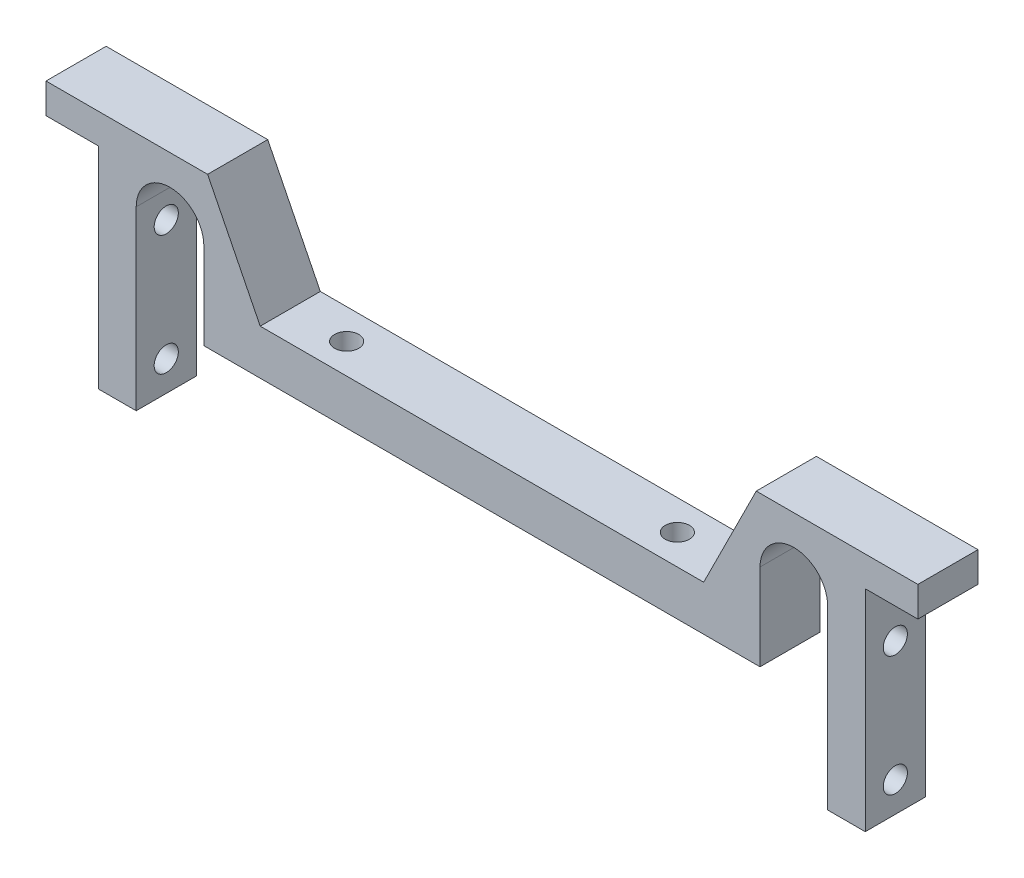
from build123d import *

# Parameters (mm, degrees)
BOSS_EXTRUDE1_DEPTH         = 6.35
F_10_CLEARANCE_HOLE1_REACH  = 178.041
F_10_CLEARANCE_HOLE1_BORE_R = 2.5527
F_10_CLEARANCE_HOLE2_D      = 5.1054


with BuildPart() as part:
    # Sketch1 → Boss-Extrude1 (new, symmetric)
    with BuildSketch(Plane.XY):
        with BuildLine():
            Line((-58.7375, 0), (58.7375, 0))
            Line((58.7375, 0), (58.7375, 18.25625))
            ThreePointArc((58.7375, 18.25625), (65.88125, 25.4), (73.025, 18.25625))
            Line((73.025, 18.25625), (73.025, -19.05))
            Line((73.025, -19.05), (80.9625, -19.05))
            Line((80.9625, -19.05), (80.9625, 25.4))
            Line((80.9625, 25.4), (92.075, 25.4))
            Line((92.075, 25.4), (92.075, 31.75))
            Line((92.075, 31.75), (57.94375, 31.75))
            Line((57.94375, 31.75), (46.83125, 9.525))
            Line((46.83125, 9.525), (-46.83125, 9.525))
            Line((-46.83125, 9.525), (-57.94375, 31.75))
            Line((-57.94375, 31.75), (-92.075, 31.75))
            Line((-92.075, 31.75), (-92.075, 25.4))
            Line((-92.075, 25.4), (-80.9625, 25.4))
            Line((-80.9625, 25.4), (-80.9625, -19.05))
            Line((-80.9625, -19.05), (-73.025, -19.05))
            Line((-73.025, -19.05), (-73.025, 18.25625))
            ThreePointArc((-73.025, 18.25625), (-65.88125, 25.4), (-58.7375, 18.25625))
            Line((-58.7375, 18.25625), (-58.7375, 0))
        make_face()
    extrude(amount=BOSS_EXTRUDE1_DEPTH, both=True)

    # 10 Clearance Hole1 bore → 10 Clearance Hole1 (cut, up to next)
    with BuildSketch(Plane(origin=(80.9625, 0, 0), x_dir=(0, 0, -1), z_dir=(1, 0, 0)), mode=Mode.PRIVATE) as f_10_clearance_hole1_sk1:
        with Locations((0, 12.7)):
            Circle(F_10_CLEARANCE_HOLE1_BORE_R)
    f_10_clearance_hole1_tool1 = extrude(f_10_clearance_hole1_sk1.sketch, amount=-F_10_CLEARANCE_HOLE1_REACH, mode=Mode.PRIVATE) & part.part
    # 10 Clearance Hole1 bore → 10 Clearance Hole1 (cut, up to next)
    with BuildSketch(Plane(origin=(80.9625, 0, 0), x_dir=(0, 0, -1), z_dir=(1, 0, 0)), mode=Mode.PRIVATE) as f_10_clearance_hole1_sk2:
        with Locations((0, -12.7)):
            Circle(F_10_CLEARANCE_HOLE1_BORE_R)
    f_10_clearance_hole1_tool2 = extrude(f_10_clearance_hole1_sk2.sketch, amount=-F_10_CLEARANCE_HOLE1_REACH, mode=Mode.PRIVATE) & part.part
    f_10_clearance_hole1_1 = f_10_clearance_hole1_tool1.solids().sort_by_distance((80.9625, 12.7, 0))[0]
    add(f_10_clearance_hole1_1, mode=Mode.SUBTRACT)
    f_10_clearance_hole1_2 = f_10_clearance_hole1_tool2.solids().sort_by_distance((80.9625, -12.7, 0))[0]
    add(f_10_clearance_hole1_2, mode=Mode.SUBTRACT)
    f_10_clearance_hole1 = f_10_clearance_hole1_1 + f_10_clearance_hole1_2  # 10 Clearance Hole1 as one shape, for the pattern or mirror that repeats it

    # Mirror1: 10 Clearance Hole1 across plane
    add(f_10_clearance_hole1.mirror(Plane(origin=(0, 0, 0), x_dir=(0, 0, 1), z_dir=(1, 0, 0))), mode=Mode.SUBTRACT)

    # 10 Clearance Hole2 (through all)
    with Locations(Plane(origin=(0, 9.525, 0), x_dir=(-1, 0, 0), z_dir=(0, 1, 0))):
        with Locations((34.925, 0), (-34.925, 0)):
            Hole(F_10_CLEARANCE_HOLE2_D / 2)


solid = part.part
